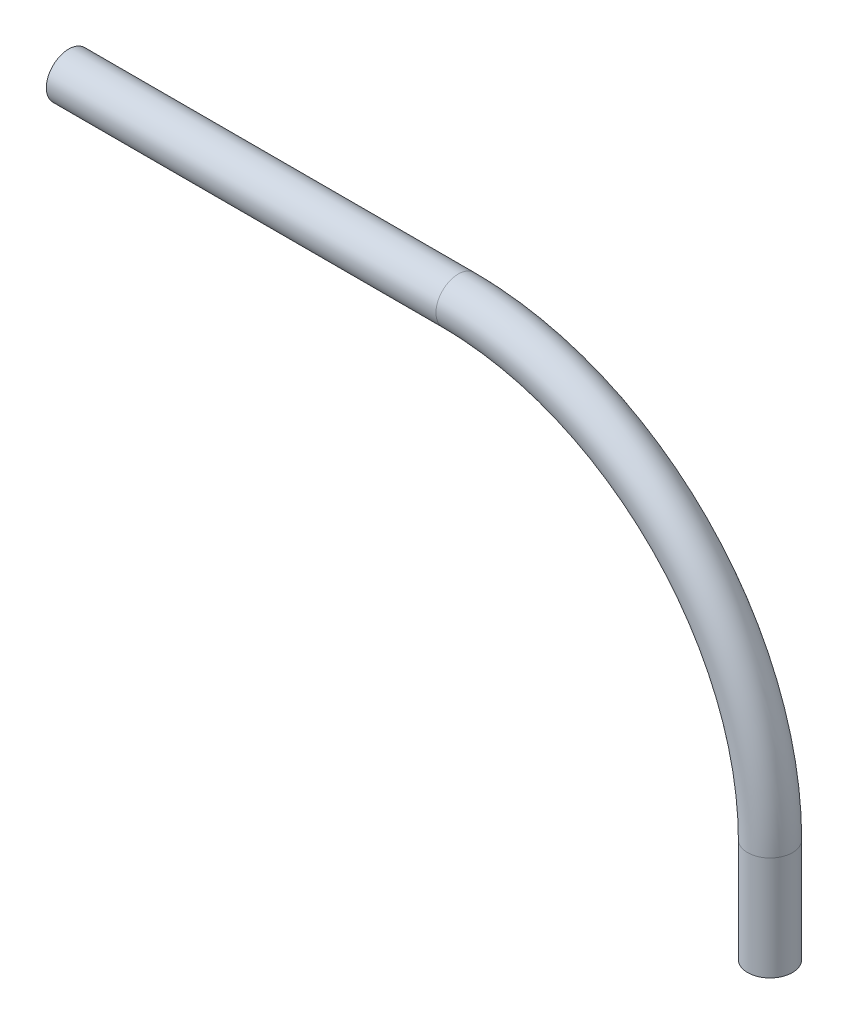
ISO-10303-21;
HEADER;
FILE_DESCRIPTION(('STEP AP214'),'2;1');
FILE_NAME('part.step','',(''),(''),'','','');
FILE_SCHEMA(('AUTOMOTIVE_DESIGN { 1 0 10303 214 1 1 1 1 }'));
ENDSEC;
DATA;
#1=APPLICATION_CONTEXT('core data for automotive mechanical design processes');
#2=APPLICATION_PROTOCOL_DEFINITION('international standard','automotive_design',2000,#1);
#3=PRODUCT_CONTEXT('',#1,'mechanical');
#4=PRODUCT('Part','Part','',(#3));
#5=PRODUCT_RELATED_PRODUCT_CATEGORY('part','',(#4));
#6=PRODUCT_DEFINITION_FORMATION('','',#4);
#7=PRODUCT_DEFINITION_CONTEXT('part definition',#1,'design');
#8=PRODUCT_DEFINITION('design','',#6,#7);
#9=PRODUCT_DEFINITION_SHAPE('','',#8);
#10=(LENGTH_UNIT() NAMED_UNIT(*) SI_UNIT(.MILLI.,.METRE.));
#11=(NAMED_UNIT(*) PLANE_ANGLE_UNIT() SI_UNIT($,.RADIAN.));
#12=(NAMED_UNIT(*) SI_UNIT($,.STERADIAN.) SOLID_ANGLE_UNIT());
#13=UNCERTAINTY_MEASURE_WITH_UNIT(LENGTH_MEASURE(1.E-05),#10,'distance_accuracy_value','');
#14=(GEOMETRIC_REPRESENTATION_CONTEXT(3) GLOBAL_UNCERTAINTY_ASSIGNED_CONTEXT((#13)) GLOBAL_UNIT_ASSIGNED_CONTEXT((#10,
#11,#12)) REPRESENTATION_CONTEXT('',''));
#15=CARTESIAN_POINT('',(0.,0.,0.));
#16=DIRECTION('',(0.,0.,1.));
#17=DIRECTION('',(1.,0.,0.));
#18=AXIS2_PLACEMENT_3D('',#15,#16,#17);
#19=CARTESIAN_POINT('',(300.,-240.,0.));
#20=DIRECTION('',(0.,0.,1.));
#21=DIRECTION('',(1.,0.,0.));
#22=AXIS2_PLACEMENT_3D('',#19,#20,#21);
#23=TOROIDAL_SURFACE('',#22,240.,14.5);
#24=CARTESIAN_POINT('',(540.,-240.,0.));
#25=DIRECTION('',(0.,1.,0.));
#26=DIRECTION('',(-1.,0.,0.));
#27=AXIS2_PLACEMENT_3D('',#24,#25,#26);
#28=CIRCLE('',#27,14.5);
#29=CARTESIAN_POINT('',(525.5,-240.,0.));
#30=VERTEX_POINT('',#29);
#31=EDGE_CURVE('E37',#30,#30,#28,.F.);
#32=ORIENTED_EDGE('',*,*,#31,.T.);
#33=EDGE_LOOP('',(#32));
#34=FACE_BOUND('',#33,.T.);
#35=CARTESIAN_POINT('',(300.,0.,0.));
#36=DIRECTION('',(-1.,0.,0.));
#37=DIRECTION('',(0.,0.,1.));
#38=AXIS2_PLACEMENT_3D('',#35,#36,#37);
#39=CIRCLE('',#38,14.5);
#40=CARTESIAN_POINT('',(300.,0.,14.5));
#41=VERTEX_POINT('',#40);
#42=EDGE_CURVE('E40',#41,#41,#39,.T.);
#43=ORIENTED_EDGE('',*,*,#42,.T.);
#44=EDGE_LOOP('',(#43));
#45=FACE_BOUND('',#44,.T.);
#46=ADVANCED_FACE('F15',(#34,#45),#23,.F.);
#47=CARTESIAN_POINT('',(300.,0.,0.));
#48=DIRECTION('',(-1.,0.,0.));
#49=DIRECTION('',(0.,0.,1.));
#50=AXIS2_PLACEMENT_3D('',#47,#48,#49);
#51=CYLINDRICAL_SURFACE('',#50,14.5);
#52=ORIENTED_EDGE('',*,*,#42,.F.);
#53=EDGE_LOOP('',(#52));
#54=FACE_BOUND('',#53,.T.);
#55=CARTESIAN_POINT('',(0.,0.,0.));
#56=DIRECTION('',(-1.,0.,0.));
#57=DIRECTION('',(0.,0.,1.));
#58=AXIS2_PLACEMENT_3D('',#55,#56,#57);
#59=CIRCLE('',#58,14.5);
#60=CARTESIAN_POINT('',(0.,0.,14.5));
#61=VERTEX_POINT('',#60);
#62=EDGE_CURVE('E19',#61,#61,#59,.T.);
#63=ORIENTED_EDGE('',*,*,#62,.T.);
#64=EDGE_LOOP('',(#63));
#65=FACE_BOUND('',#64,.T.);
#66=ADVANCED_FACE('F59',(#54,#65),#51,.F.);
#67=CARTESIAN_POINT('',(540.,-320.,0.));
#68=DIRECTION('',(0.,1.,0.));
#69=DIRECTION('',(-1.,0.,0.));
#70=AXIS2_PLACEMENT_3D('',#67,#68,#69);
#71=CYLINDRICAL_SURFACE('',#70,14.5);
#72=CARTESIAN_POINT('',(540.,-320.,0.));
#73=DIRECTION('',(0.,1.,0.));
#74=DIRECTION('',(-1.,0.,0.));
#75=AXIS2_PLACEMENT_3D('',#72,#73,#74);
#76=CIRCLE('',#75,14.5);
#77=CARTESIAN_POINT('',(525.5,-320.,0.));
#78=VERTEX_POINT('',#77);
#79=EDGE_CURVE('E52',#78,#78,#76,.T.);
#80=ORIENTED_EDGE('',*,*,#79,.F.);
#81=EDGE_LOOP('',(#80));
#82=FACE_BOUND('',#81,.T.);
#83=ORIENTED_EDGE('',*,*,#31,.F.);
#84=EDGE_LOOP('',(#83));
#85=FACE_BOUND('',#84,.T.);
#86=ADVANCED_FACE('F64',(#82,#85),#71,.F.);
#87=CARTESIAN_POINT('',(0.,0.,0.));
#88=DIRECTION('',(1.,0.,0.));
#89=DIRECTION('',(0.,0.,-1.));
#90=AXIS2_PLACEMENT_3D('',#87,#88,#89);
#91=PLANE('',#90);
#92=CARTESIAN_POINT('',(0.,0.,0.));
#93=DIRECTION('',(-1.,0.,0.));
#94=DIRECTION('',(0.,0.,1.));
#95=AXIS2_PLACEMENT_3D('',#92,#93,#94);
#96=CIRCLE('',#95,17.25);
#97=CARTESIAN_POINT('',(0.,0.,17.25));
#98=VERTEX_POINT('',#97);
#99=EDGE_CURVE('E50',#98,#98,#96,.F.);
#100=ORIENTED_EDGE('',*,*,#99,.F.);
#101=EDGE_LOOP('',(#100));
#102=FACE_BOUND('',#101,.T.);
#103=ORIENTED_EDGE('',*,*,#62,.F.);
#104=EDGE_LOOP('',(#103));
#105=FACE_BOUND('',#104,.T.);
#106=ADVANCED_FACE('F61',(#102,#105),#91,.F.);
#107=CARTESIAN_POINT('',(540.,-320.,0.));
#108=DIRECTION('',(0.,-1.,0.));
#109=DIRECTION('',(1.,0.,0.));
#110=AXIS2_PLACEMENT_3D('',#107,#108,#109);
#111=PLANE('',#110);
#112=CARTESIAN_POINT('',(540.,-320.,0.));
#113=DIRECTION('',(0.,1.,0.));
#114=DIRECTION('',(-1.,0.,0.));
#115=AXIS2_PLACEMENT_3D('',#112,#113,#114);
#116=CIRCLE('',#115,17.25);
#117=CARTESIAN_POINT('',(522.75,-320.,0.));
#118=VERTEX_POINT('',#117);
#119=EDGE_CURVE('E28',#118,#118,#116,.T.);
#120=ORIENTED_EDGE('',*,*,#119,.F.);
#121=EDGE_LOOP('',(#120));
#122=FACE_BOUND('',#121,.T.);
#123=ORIENTED_EDGE('',*,*,#79,.T.);
#124=EDGE_LOOP('',(#123));
#125=FACE_BOUND('',#124,.T.);
#126=ADVANCED_FACE('F63',(#122,#125),#111,.T.);
#127=CARTESIAN_POINT('',(300.,0.,0.));
#128=DIRECTION('',(-1.,0.,0.));
#129=DIRECTION('',(0.,0.,1.));
#130=AXIS2_PLACEMENT_3D('',#127,#128,#129);
#131=CYLINDRICAL_SURFACE('',#130,17.25);
#132=CARTESIAN_POINT('',(300.,-1.11022302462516E-13,0.));
#133=DIRECTION('',(-1.,0.,0.));
#134=DIRECTION('',(0.,1.,0.));
#135=AXIS2_PLACEMENT_3D('',#132,#133,#134);
#136=CIRCLE('',#135,17.25);
#137=CARTESIAN_POINT('',(300.,17.2499999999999,0.));
#138=VERTEX_POINT('',#137);
#139=EDGE_CURVE('E23',#138,#138,#136,.F.);
#140=ORIENTED_EDGE('',*,*,#139,.F.);
#141=EDGE_LOOP('',(#140));
#142=FACE_BOUND('',#141,.T.);
#143=ORIENTED_EDGE('',*,*,#99,.T.);
#144=EDGE_LOOP('',(#143));
#145=FACE_BOUND('',#144,.T.);
#146=ADVANCED_FACE('F72',(#142,#145),#131,.T.);
#147=CARTESIAN_POINT('',(540.,-320.,0.));
#148=DIRECTION('',(0.,1.,0.));
#149=DIRECTION('',(-1.,0.,0.));
#150=AXIS2_PLACEMENT_3D('',#147,#148,#149);
#151=CYLINDRICAL_SURFACE('',#150,17.25);
#152=ORIENTED_EDGE('',*,*,#119,.T.);
#153=EDGE_LOOP('',(#152));
#154=FACE_BOUND('',#153,.T.);
#155=CARTESIAN_POINT('',(540.,-240.,0.));
#156=DIRECTION('',(0.,1.,0.));
#157=DIRECTION('',(1.,0.,0.));
#158=AXIS2_PLACEMENT_3D('',#155,#156,#157);
#159=CIRCLE('',#158,17.25);
#160=CARTESIAN_POINT('',(557.25,-240.,0.));
#161=VERTEX_POINT('',#160);
#162=EDGE_CURVE('E10',#161,#161,#159,.T.);
#163=ORIENTED_EDGE('',*,*,#162,.F.);
#164=EDGE_LOOP('',(#163));
#165=FACE_BOUND('',#164,.T.);
#166=ADVANCED_FACE('F80',(#154,#165),#151,.T.);
#167=CARTESIAN_POINT('',(300.,-240.,0.));
#168=DIRECTION('',(0.,0.,1.));
#169=DIRECTION('',(1.,0.,0.));
#170=AXIS2_PLACEMENT_3D('',#167,#168,#169);
#171=TOROIDAL_SURFACE('',#170,240.,17.25);
#172=ORIENTED_EDGE('',*,*,#162,.T.);
#173=EDGE_LOOP('',(#172));
#174=FACE_BOUND('',#173,.T.);
#175=ORIENTED_EDGE('',*,*,#139,.T.);
#176=EDGE_LOOP('',(#175));
#177=FACE_BOUND('',#176,.T.);
#178=ADVANCED_FACE('F78',(#174,#177),#171,.T.);
#179=CLOSED_SHELL('',(#46,#66,#86,#106,#126,#146,#166,#178));
#180=MANIFOLD_SOLID_BREP('B1',#179);
#181=ADVANCED_BREP_SHAPE_REPRESENTATION('',(#18,#180),#14);
#182=SHAPE_DEFINITION_REPRESENTATION(#9,#181);
ENDSEC;
END-ISO-10303-21;
